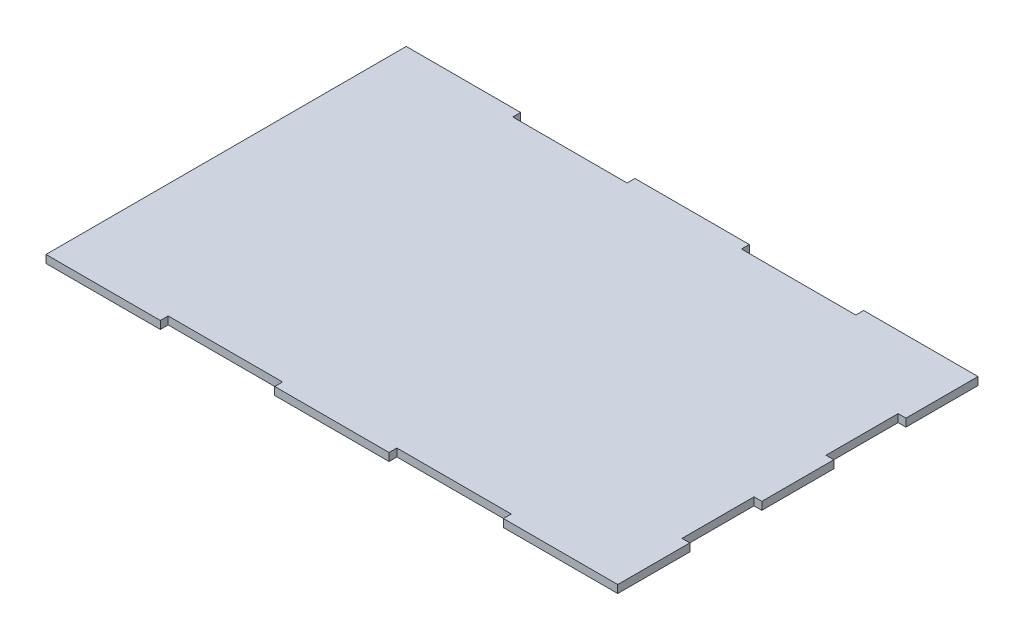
ISO-10303-21;
HEADER;
FILE_DESCRIPTION(('STEP AP214'),'2;1');
FILE_NAME('part.step','',(''),(''),'','','');
FILE_SCHEMA(('AUTOMOTIVE_DESIGN { 1 0 10303 214 1 1 1 1 }'));
ENDSEC;
DATA;
#1=APPLICATION_CONTEXT('core data for automotive mechanical design processes');
#2=APPLICATION_PROTOCOL_DEFINITION('international standard','automotive_design',2000,#1);
#3=PRODUCT_CONTEXT('',#1,'mechanical');
#4=PRODUCT('Part','Part','',(#3));
#5=PRODUCT_RELATED_PRODUCT_CATEGORY('part','',(#4));
#6=PRODUCT_DEFINITION_FORMATION('','',#4);
#7=PRODUCT_DEFINITION_CONTEXT('part definition',#1,'design');
#8=PRODUCT_DEFINITION('design','',#6,#7);
#9=PRODUCT_DEFINITION_SHAPE('','',#8);
#10=(LENGTH_UNIT() NAMED_UNIT(*) SI_UNIT(.MILLI.,.METRE.));
#11=(NAMED_UNIT(*) PLANE_ANGLE_UNIT() SI_UNIT($,.RADIAN.));
#12=(NAMED_UNIT(*) SI_UNIT($,.STERADIAN.) SOLID_ANGLE_UNIT());
#13=UNCERTAINTY_MEASURE_WITH_UNIT(LENGTH_MEASURE(1.E-05),#10,'distance_accuracy_value','');
#14=(GEOMETRIC_REPRESENTATION_CONTEXT(3) GLOBAL_UNCERTAINTY_ASSIGNED_CONTEXT((#13)) GLOBAL_UNIT_ASSIGNED_CONTEXT((#10,
#11,#12)) REPRESENTATION_CONTEXT('',''));
#15=CARTESIAN_POINT('',(0.,0.,0.));
#16=DIRECTION('',(0.,0.,1.));
#17=DIRECTION('',(1.,0.,0.));
#18=AXIS2_PLACEMENT_3D('',#15,#16,#17);
#19=CARTESIAN_POINT('',(46.355,0.,-142.875));
#20=DIRECTION('',(1.,0.,0.));
#21=DIRECTION('',(0.,0.,-1.));
#22=AXIS2_PLACEMENT_3D('',#19,#20,#21);
#23=PLANE('',#22);
#24=DIRECTION('',(0.,0.,-1.));
#25=VECTOR('',#24,1.);
#26=CARTESIAN_POINT('',(46.355,3.175,-142.875));
#27=LINE('',#26,#25);
#28=CARTESIAN_POINT('',(46.355,3.175,-142.875));
#29=VERTEX_POINT('',#28);
#30=CARTESIAN_POINT('',(46.355,3.175,-146.05));
#31=VERTEX_POINT('',#30);
#32=EDGE_CURVE('E248',#29,#31,#27,.T.);
#33=ORIENTED_EDGE('',*,*,#32,.F.);
#34=DIRECTION('',(0.,1.,0.));
#35=VECTOR('',#34,1.);
#36=CARTESIAN_POINT('',(46.355,0.,-142.875));
#37=LINE('',#36,#35);
#38=CARTESIAN_POINT('',(46.355,0.,-142.875));
#39=VERTEX_POINT('',#38);
#40=EDGE_CURVE('E11',#39,#29,#37,.T.);
#41=ORIENTED_EDGE('',*,*,#40,.F.);
#42=DIRECTION('',(0.,0.,-1.));
#43=VECTOR('',#42,1.);
#44=CARTESIAN_POINT('',(46.355,0.,-142.875));
#45=LINE('',#44,#43);
#46=CARTESIAN_POINT('',(46.355,0.,-146.05));
#47=VERTEX_POINT('',#46);
#48=EDGE_CURVE('E328',#39,#47,#45,.T.);
#49=ORIENTED_EDGE('',*,*,#48,.T.);
#50=DIRECTION('',(0.,1.,0.));
#51=VECTOR('',#50,1.);
#52=CARTESIAN_POINT('',(46.355,0.,-146.05));
#53=LINE('',#52,#51);
#54=EDGE_CURVE('E34',#47,#31,#53,.T.);
#55=ORIENTED_EDGE('',*,*,#54,.T.);
#56=EDGE_LOOP('',(#33,#41,#49,#55));
#57=FACE_BOUND('',#56,.T.);
#58=ADVANCED_FACE('F31',(#57),#23,.T.);
#59=CARTESIAN_POINT('',(92.71,0.,-142.875));
#60=DIRECTION('',(0.,0.,-1.));
#61=DIRECTION('',(-1.,0.,0.));
#62=AXIS2_PLACEMENT_3D('',#59,#60,#61);
#63=PLANE('',#62);
#64=DIRECTION('',(-1.,0.,0.));
#65=VECTOR('',#64,1.);
#66=CARTESIAN_POINT('',(92.71,3.175,-142.875));
#67=LINE('',#66,#65);
#68=CARTESIAN_POINT('',(92.71,3.175,-142.875));
#69=VERTEX_POINT('',#68);
#70=EDGE_CURVE('E326',#69,#29,#67,.T.);
#71=ORIENTED_EDGE('',*,*,#70,.F.);
#72=DIRECTION('',(0.,1.,0.));
#73=VECTOR('',#72,1.);
#74=CARTESIAN_POINT('',(92.71,0.,-142.875));
#75=LINE('',#74,#73);
#76=CARTESIAN_POINT('',(92.71,0.,-142.875));
#77=VERTEX_POINT('',#76);
#78=EDGE_CURVE('E40',#77,#69,#75,.T.);
#79=ORIENTED_EDGE('',*,*,#78,.F.);
#80=DIRECTION('',(-1.,0.,0.));
#81=VECTOR('',#80,1.);
#82=CARTESIAN_POINT('',(92.71,0.,-142.875));
#83=LINE('',#82,#81);
#84=EDGE_CURVE('E238',#77,#39,#83,.T.);
#85=ORIENTED_EDGE('',*,*,#84,.T.);
#86=ORIENTED_EDGE('',*,*,#40,.T.);
#87=EDGE_LOOP('',(#71,#79,#85,#86));
#88=FACE_BOUND('',#87,.T.);
#89=ADVANCED_FACE('F380',(#88),#63,.T.);
#90=CARTESIAN_POINT('',(92.71,0.,-146.05));
#91=DIRECTION('',(-1.,0.,0.));
#92=DIRECTION('',(0.,0.,1.));
#93=AXIS2_PLACEMENT_3D('',#90,#91,#92);
#94=PLANE('',#93);
#95=DIRECTION('',(0.,0.,1.));
#96=VECTOR('',#95,1.);
#97=CARTESIAN_POINT('',(92.71,3.175,-146.05));
#98=LINE('',#97,#96);
#99=CARTESIAN_POINT('',(92.71,3.175,-146.05));
#100=VERTEX_POINT('',#99);
#101=EDGE_CURVE('E225',#100,#69,#98,.T.);
#102=ORIENTED_EDGE('',*,*,#101,.F.);
#103=DIRECTION('',(0.,1.,0.));
#104=VECTOR('',#103,1.);
#105=CARTESIAN_POINT('',(92.71,0.,-146.05));
#106=LINE('',#105,#104);
#107=CARTESIAN_POINT('',(92.71,0.,-146.05));
#108=VERTEX_POINT('',#107);
#109=EDGE_CURVE('E220',#108,#100,#106,.T.);
#110=ORIENTED_EDGE('',*,*,#109,.F.);
#111=DIRECTION('',(0.,0.,1.));
#112=VECTOR('',#111,1.);
#113=CARTESIAN_POINT('',(92.71,0.,-146.05));
#114=LINE('',#113,#112);
#115=EDGE_CURVE('E223',#108,#77,#114,.T.);
#116=ORIENTED_EDGE('',*,*,#115,.T.);
#117=ORIENTED_EDGE('',*,*,#78,.T.);
#118=EDGE_LOOP('',(#102,#110,#116,#117));
#119=FACE_BOUND('',#118,.T.);
#120=ADVANCED_FACE('F222',(#119),#94,.T.);
#121=CARTESIAN_POINT('',(139.065,0.,-146.05));
#122=DIRECTION('',(0.,0.,-1.));
#123=DIRECTION('',(-1.,0.,0.));
#124=AXIS2_PLACEMENT_3D('',#121,#122,#123);
#125=PLANE('',#124);
#126=DIRECTION('',(-1.,0.,0.));
#127=VECTOR('',#126,1.);
#128=CARTESIAN_POINT('',(139.065,3.175,-146.05));
#129=LINE('',#128,#127);
#130=CARTESIAN_POINT('',(139.065,3.175,-146.05));
#131=VERTEX_POINT('',#130);
#132=EDGE_CURVE('E323',#131,#100,#129,.T.);
#133=ORIENTED_EDGE('',*,*,#132,.F.);
#134=DIRECTION('',(0.,1.,0.));
#135=VECTOR('',#134,1.);
#136=CARTESIAN_POINT('',(139.065,0.,-146.05));
#137=LINE('',#136,#135);
#138=CARTESIAN_POINT('',(139.065,0.,-146.05));
#139=VERTEX_POINT('',#138);
#140=EDGE_CURVE('E230',#139,#131,#137,.T.);
#141=ORIENTED_EDGE('',*,*,#140,.F.);
#142=DIRECTION('',(-1.,0.,0.));
#143=VECTOR('',#142,1.);
#144=CARTESIAN_POINT('',(139.065,0.,-146.05));
#145=LINE('',#144,#143);
#146=EDGE_CURVE('E236',#139,#108,#145,.T.);
#147=ORIENTED_EDGE('',*,*,#146,.T.);
#148=ORIENTED_EDGE('',*,*,#109,.T.);
#149=EDGE_LOOP('',(#133,#141,#147,#148));
#150=FACE_BOUND('',#149,.T.);
#151=ADVANCED_FACE('F240',(#150),#125,.T.);
#152=CARTESIAN_POINT('',(139.065,0.,-142.875));
#153=DIRECTION('',(1.,0.,0.));
#154=DIRECTION('',(0.,0.,-1.));
#155=AXIS2_PLACEMENT_3D('',#152,#153,#154);
#156=PLANE('',#155);
#157=DIRECTION('',(0.,0.,-1.));
#158=VECTOR('',#157,1.);
#159=CARTESIAN_POINT('',(139.065,3.175,-142.875));
#160=LINE('',#159,#158);
#161=CARTESIAN_POINT('',(139.065,3.175,-142.875));
#162=VERTEX_POINT('',#161);
#163=EDGE_CURVE('E320',#162,#131,#160,.T.);
#164=ORIENTED_EDGE('',*,*,#163,.F.);
#165=DIRECTION('',(0.,1.,0.));
#166=VECTOR('',#165,1.);
#167=CARTESIAN_POINT('',(139.065,0.,-142.875));
#168=LINE('',#167,#166);
#169=CARTESIAN_POINT('',(139.065,0.,-142.875));
#170=VERTEX_POINT('',#169);
#171=EDGE_CURVE('E332',#170,#162,#168,.T.);
#172=ORIENTED_EDGE('',*,*,#171,.F.);
#173=DIRECTION('',(0.,0.,-1.));
#174=VECTOR('',#173,1.);
#175=CARTESIAN_POINT('',(139.065,0.,-142.875));
#176=LINE('',#175,#174);
#177=EDGE_CURVE('E241',#170,#139,#176,.T.);
#178=ORIENTED_EDGE('',*,*,#177,.T.);
#179=ORIENTED_EDGE('',*,*,#140,.T.);
#180=EDGE_LOOP('',(#164,#172,#178,#179));
#181=FACE_BOUND('',#180,.T.);
#182=ADVANCED_FACE('F393',(#181),#156,.T.);
#183=CARTESIAN_POINT('',(185.42,0.,-142.875));
#184=DIRECTION('',(0.,0.,-1.));
#185=DIRECTION('',(-1.,0.,0.));
#186=AXIS2_PLACEMENT_3D('',#183,#184,#185);
#187=PLANE('',#186);
#188=DIRECTION('',(-1.,0.,0.));
#189=VECTOR('',#188,1.);
#190=CARTESIAN_POINT('',(185.42,3.175,-142.875));
#191=LINE('',#190,#189);
#192=CARTESIAN_POINT('',(185.42,3.175,-142.875));
#193=VERTEX_POINT('',#192);
#194=EDGE_CURVE('E317',#193,#162,#191,.T.);
#195=ORIENTED_EDGE('',*,*,#194,.F.);
#196=DIRECTION('',(0.,1.,0.));
#197=VECTOR('',#196,1.);
#198=CARTESIAN_POINT('',(185.42,0.,-142.875));
#199=LINE('',#198,#197);
#200=CARTESIAN_POINT('',(185.42,0.,-142.875));
#201=VERTEX_POINT('',#200);
#202=EDGE_CURVE('E334',#201,#193,#199,.T.);
#203=ORIENTED_EDGE('',*,*,#202,.F.);
#204=DIRECTION('',(-1.,0.,0.));
#205=VECTOR('',#204,1.);
#206=CARTESIAN_POINT('',(185.42,0.,-142.875));
#207=LINE('',#206,#205);
#208=EDGE_CURVE('E243',#201,#170,#207,.T.);
#209=ORIENTED_EDGE('',*,*,#208,.T.);
#210=ORIENTED_EDGE('',*,*,#171,.T.);
#211=EDGE_LOOP('',(#195,#203,#209,#210));
#212=FACE_BOUND('',#211,.T.);
#213=ADVANCED_FACE('F396',(#212),#187,.T.);
#214=CARTESIAN_POINT('',(185.42,0.,-146.05));
#215=DIRECTION('',(-1.,0.,0.));
#216=DIRECTION('',(0.,0.,1.));
#217=AXIS2_PLACEMENT_3D('',#214,#215,#216);
#218=PLANE('',#217);
#219=DIRECTION('',(0.,0.,1.));
#220=VECTOR('',#219,1.);
#221=CARTESIAN_POINT('',(185.42,3.175,-146.05));
#222=LINE('',#221,#220);
#223=CARTESIAN_POINT('',(185.42,3.175,-146.05));
#224=VERTEX_POINT('',#223);
#225=EDGE_CURVE('E314',#224,#193,#222,.T.);
#226=ORIENTED_EDGE('',*,*,#225,.F.);
#227=DIRECTION('',(0.,1.,0.));
#228=VECTOR('',#227,1.);
#229=CARTESIAN_POINT('',(185.42,0.,-146.05));
#230=LINE('',#229,#228);
#231=CARTESIAN_POINT('',(185.42,0.,-146.05));
#232=VERTEX_POINT('',#231);
#233=EDGE_CURVE('E336',#232,#224,#230,.T.);
#234=ORIENTED_EDGE('',*,*,#233,.F.);
#235=DIRECTION('',(0.,0.,1.));
#236=VECTOR('',#235,1.);
#237=CARTESIAN_POINT('',(185.42,0.,-146.05));
#238=LINE('',#237,#236);
#239=EDGE_CURVE('E741',#232,#201,#238,.T.);
#240=ORIENTED_EDGE('',*,*,#239,.T.);
#241=ORIENTED_EDGE('',*,*,#202,.T.);
#242=EDGE_LOOP('',(#226,#234,#240,#241));
#243=FACE_BOUND('',#242,.T.);
#244=ADVANCED_FACE('F400',(#243),#218,.T.);
#245=CARTESIAN_POINT('',(231.775,0.,-146.05));
#246=DIRECTION('',(0.,0.,-1.));
#247=DIRECTION('',(-1.,0.,0.));
#248=AXIS2_PLACEMENT_3D('',#245,#246,#247);
#249=PLANE('',#248);
#250=DIRECTION('',(-1.,0.,0.));
#251=VECTOR('',#250,1.);
#252=CARTESIAN_POINT('',(231.775,3.175,-146.05));
#253=LINE('',#252,#251);
#254=CARTESIAN_POINT('',(231.775,3.175,-146.05));
#255=VERTEX_POINT('',#254);
#256=EDGE_CURVE('E311',#255,#224,#253,.T.);
#257=ORIENTED_EDGE('',*,*,#256,.F.);
#258=DIRECTION('',(0.,1.,0.));
#259=VECTOR('',#258,1.);
#260=CARTESIAN_POINT('',(231.775,0.,-146.05));
#261=LINE('',#260,#259);
#262=CARTESIAN_POINT('',(231.775,0.,-146.05));
#263=VERTEX_POINT('',#262);
#264=EDGE_CURVE('E338',#263,#255,#261,.T.);
#265=ORIENTED_EDGE('',*,*,#264,.F.);
#266=DIRECTION('',(-1.,0.,0.));
#267=VECTOR('',#266,1.);
#268=CARTESIAN_POINT('',(231.775,0.,-146.05));
#269=LINE('',#268,#267);
#270=EDGE_CURVE('E737',#263,#232,#269,.T.);
#271=ORIENTED_EDGE('',*,*,#270,.T.);
#272=ORIENTED_EDGE('',*,*,#233,.T.);
#273=EDGE_LOOP('',(#257,#265,#271,#272));
#274=FACE_BOUND('',#273,.T.);
#275=ADVANCED_FACE('F404',(#274),#249,.T.);
#276=CARTESIAN_POINT('',(231.775,0.,-116.84));
#277=DIRECTION('',(1.,0.,0.));
#278=DIRECTION('',(0.,0.,-1.));
#279=AXIS2_PLACEMENT_3D('',#276,#277,#278);
#280=PLANE('',#279);
#281=DIRECTION('',(0.,0.,-1.));
#282=VECTOR('',#281,1.);
#283=CARTESIAN_POINT('',(231.775,3.175,-116.84));
#284=LINE('',#283,#282);
#285=CARTESIAN_POINT('',(231.775,3.175,-116.84));
#286=VERTEX_POINT('',#285);
#287=EDGE_CURVE('E308',#286,#255,#284,.T.);
#288=ORIENTED_EDGE('',*,*,#287,.F.);
#289=DIRECTION('',(0.,1.,0.));
#290=VECTOR('',#289,1.);
#291=CARTESIAN_POINT('',(231.775,0.,-116.84));
#292=LINE('',#291,#290);
#293=CARTESIAN_POINT('',(231.775,0.,-116.84));
#294=VERTEX_POINT('',#293);
#295=EDGE_CURVE('E340',#294,#286,#292,.T.);
#296=ORIENTED_EDGE('',*,*,#295,.F.);
#297=DIRECTION('',(0.,0.,-1.));
#298=VECTOR('',#297,1.);
#299=CARTESIAN_POINT('',(231.775,0.,-116.84));
#300=LINE('',#299,#298);
#301=EDGE_CURVE('E748',#294,#263,#300,.T.);
#302=ORIENTED_EDGE('',*,*,#301,.T.);
#303=ORIENTED_EDGE('',*,*,#264,.T.);
#304=EDGE_LOOP('',(#288,#296,#302,#303));
#305=FACE_BOUND('',#304,.T.);
#306=ADVANCED_FACE('F408',(#305),#280,.T.);
#307=CARTESIAN_POINT('',(228.6,0.,-116.84));
#308=DIRECTION('',(0.,0.,1.));
#309=DIRECTION('',(1.,0.,0.));
#310=AXIS2_PLACEMENT_3D('',#307,#308,#309);
#311=PLANE('',#310);
#312=DIRECTION('',(1.,0.,0.));
#313=VECTOR('',#312,1.);
#314=CARTESIAN_POINT('',(228.6,3.175,-116.84));
#315=LINE('',#314,#313);
#316=CARTESIAN_POINT('',(228.6,3.175,-116.84));
#317=VERTEX_POINT('',#316);
#318=EDGE_CURVE('E305',#317,#286,#315,.T.);
#319=ORIENTED_EDGE('',*,*,#318,.F.);
#320=DIRECTION('',(0.,1.,0.));
#321=VECTOR('',#320,1.);
#322=CARTESIAN_POINT('',(228.6,0.,-116.84));
#323=LINE('',#322,#321);
#324=CARTESIAN_POINT('',(228.6,0.,-116.84));
#325=VERTEX_POINT('',#324);
#326=EDGE_CURVE('E342',#325,#317,#323,.T.);
#327=ORIENTED_EDGE('',*,*,#326,.F.);
#328=DIRECTION('',(1.,0.,0.));
#329=VECTOR('',#328,1.);
#330=CARTESIAN_POINT('',(228.6,0.,-116.84));
#331=LINE('',#330,#329);
#332=EDGE_CURVE('E730',#325,#294,#331,.T.);
#333=ORIENTED_EDGE('',*,*,#332,.T.);
#334=ORIENTED_EDGE('',*,*,#295,.T.);
#335=EDGE_LOOP('',(#319,#327,#333,#334));
#336=FACE_BOUND('',#335,.T.);
#337=ADVANCED_FACE('F412',(#336),#311,.T.);
#338=CARTESIAN_POINT('',(228.6,0.,-87.63));
#339=DIRECTION('',(1.,0.,0.));
#340=DIRECTION('',(0.,0.,-1.));
#341=AXIS2_PLACEMENT_3D('',#338,#339,#340);
#342=PLANE('',#341);
#343=DIRECTION('',(0.,0.,-1.));
#344=VECTOR('',#343,1.);
#345=CARTESIAN_POINT('',(228.6,3.175,-87.63));
#346=LINE('',#345,#344);
#347=CARTESIAN_POINT('',(228.6,3.175,-87.63));
#348=VERTEX_POINT('',#347);
#349=EDGE_CURVE('E302',#348,#317,#346,.T.);
#350=ORIENTED_EDGE('',*,*,#349,.F.);
#351=DIRECTION('',(0.,1.,0.));
#352=VECTOR('',#351,1.);
#353=CARTESIAN_POINT('',(228.6,0.,-87.63));
#354=LINE('',#353,#352);
#355=CARTESIAN_POINT('',(228.6,0.,-87.63));
#356=VERTEX_POINT('',#355);
#357=EDGE_CURVE('E344',#356,#348,#354,.T.);
#358=ORIENTED_EDGE('',*,*,#357,.F.);
#359=DIRECTION('',(0.,0.,-1.));
#360=VECTOR('',#359,1.);
#361=CARTESIAN_POINT('',(228.6,0.,-87.63));
#362=LINE('',#361,#360);
#363=EDGE_CURVE('E726',#356,#325,#362,.T.);
#364=ORIENTED_EDGE('',*,*,#363,.T.);
#365=ORIENTED_EDGE('',*,*,#326,.T.);
#366=EDGE_LOOP('',(#350,#358,#364,#365));
#367=FACE_BOUND('',#366,.T.);
#368=ADVANCED_FACE('F416',(#367),#342,.T.);
#369=CARTESIAN_POINT('',(231.775,0.,-87.63));
#370=DIRECTION('',(0.,0.,-1.));
#371=DIRECTION('',(-1.,0.,0.));
#372=AXIS2_PLACEMENT_3D('',#369,#370,#371);
#373=PLANE('',#372);
#374=DIRECTION('',(-1.,0.,0.));
#375=VECTOR('',#374,1.);
#376=CARTESIAN_POINT('',(231.775,3.175,-87.63));
#377=LINE('',#376,#375);
#378=CARTESIAN_POINT('',(231.775,3.175,-87.63));
#379=VERTEX_POINT('',#378);
#380=EDGE_CURVE('E299',#379,#348,#377,.T.);
#381=ORIENTED_EDGE('',*,*,#380,.F.);
#382=DIRECTION('',(0.,1.,0.));
#383=VECTOR('',#382,1.);
#384=CARTESIAN_POINT('',(231.775,0.,-87.63));
#385=LINE('',#384,#383);
#386=CARTESIAN_POINT('',(231.775,0.,-87.63));
#387=VERTEX_POINT('',#386);
#388=EDGE_CURVE('E346',#387,#379,#385,.T.);
#389=ORIENTED_EDGE('',*,*,#388,.F.);
#390=DIRECTION('',(-1.,0.,0.));
#391=VECTOR('',#390,1.);
#392=CARTESIAN_POINT('',(231.775,0.,-87.63));
#393=LINE('',#392,#391);
#394=EDGE_CURVE('E752',#387,#356,#393,.T.);
#395=ORIENTED_EDGE('',*,*,#394,.T.);
#396=ORIENTED_EDGE('',*,*,#357,.T.);
#397=EDGE_LOOP('',(#381,#389,#395,#396));
#398=FACE_BOUND('',#397,.T.);
#399=ADVANCED_FACE('F420',(#398),#373,.T.);
#400=CARTESIAN_POINT('',(231.775,0.,-58.42));
#401=DIRECTION('',(1.,0.,0.));
#402=DIRECTION('',(0.,0.,-1.));
#403=AXIS2_PLACEMENT_3D('',#400,#401,#402);
#404=PLANE('',#403);
#405=DIRECTION('',(0.,0.,-1.));
#406=VECTOR('',#405,1.);
#407=CARTESIAN_POINT('',(231.775,3.175,-58.42));
#408=LINE('',#407,#406);
#409=CARTESIAN_POINT('',(231.775,3.175,-58.42));
#410=VERTEX_POINT('',#409);
#411=EDGE_CURVE('E296',#410,#379,#408,.T.);
#412=ORIENTED_EDGE('',*,*,#411,.F.);
#413=DIRECTION('',(0.,1.,0.));
#414=VECTOR('',#413,1.);
#415=CARTESIAN_POINT('',(231.775,0.,-58.42));
#416=LINE('',#415,#414);
#417=CARTESIAN_POINT('',(231.775,0.,-58.42));
#418=VERTEX_POINT('',#417);
#419=EDGE_CURVE('E348',#418,#410,#416,.T.);
#420=ORIENTED_EDGE('',*,*,#419,.F.);
#421=DIRECTION('',(0.,0.,-1.));
#422=VECTOR('',#421,1.);
#423=CARTESIAN_POINT('',(231.775,0.,-58.42));
#424=LINE('',#423,#422);
#425=EDGE_CURVE('E719',#418,#387,#424,.T.);
#426=ORIENTED_EDGE('',*,*,#425,.T.);
#427=ORIENTED_EDGE('',*,*,#388,.T.);
#428=EDGE_LOOP('',(#412,#420,#426,#427));
#429=FACE_BOUND('',#428,.T.);
#430=ADVANCED_FACE('F424',(#429),#404,.T.);
#431=CARTESIAN_POINT('',(228.6,0.,-58.42));
#432=DIRECTION('',(0.,0.,1.));
#433=DIRECTION('',(1.,0.,0.));
#434=AXIS2_PLACEMENT_3D('',#431,#432,#433);
#435=PLANE('',#434);
#436=DIRECTION('',(1.,0.,0.));
#437=VECTOR('',#436,1.);
#438=CARTESIAN_POINT('',(228.6,3.175,-58.42));
#439=LINE('',#438,#437);
#440=CARTESIAN_POINT('',(228.6,3.175,-58.42));
#441=VERTEX_POINT('',#440);
#442=EDGE_CURVE('E293',#441,#410,#439,.T.);
#443=ORIENTED_EDGE('',*,*,#442,.F.);
#444=DIRECTION('',(0.,1.,0.));
#445=VECTOR('',#444,1.);
#446=CARTESIAN_POINT('',(228.6,0.,-58.42));
#447=LINE('',#446,#445);
#448=CARTESIAN_POINT('',(228.6,0.,-58.42));
#449=VERTEX_POINT('',#448);
#450=EDGE_CURVE('E350',#449,#441,#447,.T.);
#451=ORIENTED_EDGE('',*,*,#450,.F.);
#452=DIRECTION('',(1.,0.,0.));
#453=VECTOR('',#452,1.);
#454=CARTESIAN_POINT('',(228.6,0.,-58.42));
#455=LINE('',#454,#453);
#456=EDGE_CURVE('E715',#449,#418,#455,.T.);
#457=ORIENTED_EDGE('',*,*,#456,.T.);
#458=ORIENTED_EDGE('',*,*,#419,.T.);
#459=EDGE_LOOP('',(#443,#451,#457,#458));
#460=FACE_BOUND('',#459,.T.);
#461=ADVANCED_FACE('F428',(#460),#435,.T.);
#462=CARTESIAN_POINT('',(228.6,0.,-29.21));
#463=DIRECTION('',(1.,0.,0.));
#464=DIRECTION('',(0.,0.,-1.));
#465=AXIS2_PLACEMENT_3D('',#462,#463,#464);
#466=PLANE('',#465);
#467=DIRECTION('',(0.,0.,-1.));
#468=VECTOR('',#467,1.);
#469=CARTESIAN_POINT('',(228.6,3.175,-29.21));
#470=LINE('',#469,#468);
#471=CARTESIAN_POINT('',(228.6,3.175,-29.21));
#472=VERTEX_POINT('',#471);
#473=EDGE_CURVE('E290',#472,#441,#470,.T.);
#474=ORIENTED_EDGE('',*,*,#473,.F.);
#475=DIRECTION('',(0.,1.,0.));
#476=VECTOR('',#475,1.);
#477=CARTESIAN_POINT('',(228.6,0.,-29.21));
#478=LINE('',#477,#476);
#479=CARTESIAN_POINT('',(228.6,0.,-29.21));
#480=VERTEX_POINT('',#479);
#481=EDGE_CURVE('E352',#480,#472,#478,.T.);
#482=ORIENTED_EDGE('',*,*,#481,.F.);
#483=DIRECTION('',(0.,0.,-1.));
#484=VECTOR('',#483,1.);
#485=CARTESIAN_POINT('',(228.6,0.,-29.21));
#486=LINE('',#485,#484);
#487=EDGE_CURVE('E756',#480,#449,#486,.T.);
#488=ORIENTED_EDGE('',*,*,#487,.T.);
#489=ORIENTED_EDGE('',*,*,#450,.T.);
#490=EDGE_LOOP('',(#474,#482,#488,#489));
#491=FACE_BOUND('',#490,.T.);
#492=ADVANCED_FACE('F432',(#491),#466,.T.);
#493=CARTESIAN_POINT('',(231.775,0.,-29.21));
#494=DIRECTION('',(0.,0.,-1.));
#495=DIRECTION('',(-1.,0.,0.));
#496=AXIS2_PLACEMENT_3D('',#493,#494,#495);
#497=PLANE('',#496);
#498=DIRECTION('',(-1.,0.,0.));
#499=VECTOR('',#498,1.);
#500=CARTESIAN_POINT('',(231.775,3.175,-29.21));
#501=LINE('',#500,#499);
#502=CARTESIAN_POINT('',(231.775,3.175,-29.21));
#503=VERTEX_POINT('',#502);
#504=EDGE_CURVE('E287',#503,#472,#501,.T.);
#505=ORIENTED_EDGE('',*,*,#504,.F.);
#506=DIRECTION('',(0.,1.,0.));
#507=VECTOR('',#506,1.);
#508=CARTESIAN_POINT('',(231.775,0.,-29.21));
#509=LINE('',#508,#507);
#510=CARTESIAN_POINT('',(231.775,0.,-29.21));
#511=VERTEX_POINT('',#510);
#512=EDGE_CURVE('E354',#511,#503,#509,.T.);
#513=ORIENTED_EDGE('',*,*,#512,.F.);
#514=DIRECTION('',(-1.,0.,0.));
#515=VECTOR('',#514,1.);
#516=CARTESIAN_POINT('',(231.775,0.,-29.21));
#517=LINE('',#516,#515);
#518=EDGE_CURVE('E708',#511,#480,#517,.T.);
#519=ORIENTED_EDGE('',*,*,#518,.T.);
#520=ORIENTED_EDGE('',*,*,#481,.T.);
#521=EDGE_LOOP('',(#505,#513,#519,#520));
#522=FACE_BOUND('',#521,.T.);
#523=ADVANCED_FACE('F436',(#522),#497,.T.);
#524=CARTESIAN_POINT('',(231.775,0.,0.));
#525=DIRECTION('',(1.,0.,0.));
#526=DIRECTION('',(0.,0.,-1.));
#527=AXIS2_PLACEMENT_3D('',#524,#525,#526);
#528=PLANE('',#527);
#529=DIRECTION('',(0.,0.,-1.));
#530=VECTOR('',#529,1.);
#531=CARTESIAN_POINT('',(231.775,3.175,0.));
#532=LINE('',#531,#530);
#533=CARTESIAN_POINT('',(231.775,3.175,0.));
#534=VERTEX_POINT('',#533);
#535=EDGE_CURVE('E284',#534,#503,#532,.T.);
#536=ORIENTED_EDGE('',*,*,#535,.F.);
#537=DIRECTION('',(0.,1.,0.));
#538=VECTOR('',#537,1.);
#539=CARTESIAN_POINT('',(231.775,0.,0.));
#540=LINE('',#539,#538);
#541=CARTESIAN_POINT('',(231.775,0.,0.));
#542=VERTEX_POINT('',#541);
#543=EDGE_CURVE('E356',#542,#534,#540,.T.);
#544=ORIENTED_EDGE('',*,*,#543,.F.);
#545=DIRECTION('',(0.,0.,-1.));
#546=VECTOR('',#545,1.);
#547=CARTESIAN_POINT('',(231.775,0.,0.));
#548=LINE('',#547,#546);
#549=EDGE_CURVE('E704',#542,#511,#548,.T.);
#550=ORIENTED_EDGE('',*,*,#549,.T.);
#551=ORIENTED_EDGE('',*,*,#512,.T.);
#552=EDGE_LOOP('',(#536,#544,#550,#551));
#553=FACE_BOUND('',#552,.T.);
#554=ADVANCED_FACE('F440',(#553),#528,.T.);
#555=CARTESIAN_POINT('',(185.42,0.,0.));
#556=DIRECTION('',(0.,0.,1.));
#557=DIRECTION('',(1.,0.,0.));
#558=AXIS2_PLACEMENT_3D('',#555,#556,#557);
#559=PLANE('',#558);
#560=DIRECTION('',(1.,0.,0.));
#561=VECTOR('',#560,1.);
#562=CARTESIAN_POINT('',(185.42,3.175,0.));
#563=LINE('',#562,#561);
#564=CARTESIAN_POINT('',(185.42,3.175,0.));
#565=VERTEX_POINT('',#564);
#566=EDGE_CURVE('E281',#565,#534,#563,.T.);
#567=ORIENTED_EDGE('',*,*,#566,.F.);
#568=DIRECTION('',(0.,1.,0.));
#569=VECTOR('',#568,1.);
#570=CARTESIAN_POINT('',(185.42,0.,0.));
#571=LINE('',#570,#569);
#572=CARTESIAN_POINT('',(185.42,0.,0.));
#573=VERTEX_POINT('',#572);
#574=EDGE_CURVE('E358',#573,#565,#571,.T.);
#575=ORIENTED_EDGE('',*,*,#574,.F.);
#576=DIRECTION('',(1.,0.,0.));
#577=VECTOR('',#576,1.);
#578=CARTESIAN_POINT('',(185.42,0.,0.));
#579=LINE('',#578,#577);
#580=EDGE_CURVE('E760',#573,#542,#579,.T.);
#581=ORIENTED_EDGE('',*,*,#580,.T.);
#582=ORIENTED_EDGE('',*,*,#543,.T.);
#583=EDGE_LOOP('',(#567,#575,#581,#582));
#584=FACE_BOUND('',#583,.T.);
#585=ADVANCED_FACE('F444',(#584),#559,.T.);
#586=CARTESIAN_POINT('',(185.42,0.,-3.175));
#587=DIRECTION('',(-1.,0.,0.));
#588=DIRECTION('',(0.,0.,1.));
#589=AXIS2_PLACEMENT_3D('',#586,#587,#588);
#590=PLANE('',#589);
#591=DIRECTION('',(0.,0.,1.));
#592=VECTOR('',#591,1.);
#593=CARTESIAN_POINT('',(185.42,3.175,-3.175));
#594=LINE('',#593,#592);
#595=CARTESIAN_POINT('',(185.42,3.175,-3.175));
#596=VERTEX_POINT('',#595);
#597=EDGE_CURVE('E278',#596,#565,#594,.T.);
#598=ORIENTED_EDGE('',*,*,#597,.F.);
#599=DIRECTION('',(0.,1.,0.));
#600=VECTOR('',#599,1.);
#601=CARTESIAN_POINT('',(185.42,0.,-3.175));
#602=LINE('',#601,#600);
#603=CARTESIAN_POINT('',(185.42,0.,-3.175));
#604=VERTEX_POINT('',#603);
#605=EDGE_CURVE('E360',#604,#596,#602,.T.);
#606=ORIENTED_EDGE('',*,*,#605,.F.);
#607=DIRECTION('',(0.,0.,1.));
#608=VECTOR('',#607,1.);
#609=CARTESIAN_POINT('',(185.42,0.,-3.175));
#610=LINE('',#609,#608);
#611=EDGE_CURVE('E697',#604,#573,#610,.T.);
#612=ORIENTED_EDGE('',*,*,#611,.T.);
#613=ORIENTED_EDGE('',*,*,#574,.T.);
#614=EDGE_LOOP('',(#598,#606,#612,#613));
#615=FACE_BOUND('',#614,.T.);
#616=ADVANCED_FACE('F448',(#615),#590,.T.);
#617=CARTESIAN_POINT('',(139.065,0.,-3.175));
#618=DIRECTION('',(0.,0.,1.));
#619=DIRECTION('',(1.,0.,0.));
#620=AXIS2_PLACEMENT_3D('',#617,#618,#619);
#621=PLANE('',#620);
#622=DIRECTION('',(1.,0.,0.));
#623=VECTOR('',#622,1.);
#624=CARTESIAN_POINT('',(139.065,3.175,-3.175));
#625=LINE('',#624,#623);
#626=CARTESIAN_POINT('',(139.065,3.175,-3.175));
#627=VERTEX_POINT('',#626);
#628=EDGE_CURVE('E275',#627,#596,#625,.T.);
#629=ORIENTED_EDGE('',*,*,#628,.F.);
#630=DIRECTION('',(0.,1.,0.));
#631=VECTOR('',#630,1.);
#632=CARTESIAN_POINT('',(139.065,0.,-3.175));
#633=LINE('',#632,#631);
#634=CARTESIAN_POINT('',(139.065,0.,-3.175));
#635=VERTEX_POINT('',#634);
#636=EDGE_CURVE('E362',#635,#627,#633,.T.);
#637=ORIENTED_EDGE('',*,*,#636,.F.);
#638=DIRECTION('',(1.,0.,0.));
#639=VECTOR('',#638,1.);
#640=CARTESIAN_POINT('',(139.065,0.,-3.175));
#641=LINE('',#640,#639);
#642=EDGE_CURVE('E693',#635,#604,#641,.T.);
#643=ORIENTED_EDGE('',*,*,#642,.T.);
#644=ORIENTED_EDGE('',*,*,#605,.T.);
#645=EDGE_LOOP('',(#629,#637,#643,#644));
#646=FACE_BOUND('',#645,.T.);
#647=ADVANCED_FACE('F452',(#646),#621,.T.);
#648=CARTESIAN_POINT('',(139.065,0.,0.));
#649=DIRECTION('',(1.,0.,0.));
#650=DIRECTION('',(0.,0.,-1.));
#651=AXIS2_PLACEMENT_3D('',#648,#649,#650);
#652=PLANE('',#651);
#653=DIRECTION('',(0.,0.,-1.));
#654=VECTOR('',#653,1.);
#655=CARTESIAN_POINT('',(139.065,3.175,0.));
#656=LINE('',#655,#654);
#657=CARTESIAN_POINT('',(139.065,3.175,0.));
#658=VERTEX_POINT('',#657);
#659=EDGE_CURVE('E272',#658,#627,#656,.T.);
#660=ORIENTED_EDGE('',*,*,#659,.F.);
#661=DIRECTION('',(0.,1.,0.));
#662=VECTOR('',#661,1.);
#663=CARTESIAN_POINT('',(139.065,0.,0.));
#664=LINE('',#663,#662);
#665=CARTESIAN_POINT('',(139.065,0.,0.));
#666=VERTEX_POINT('',#665);
#667=EDGE_CURVE('E364',#666,#658,#664,.T.);
#668=ORIENTED_EDGE('',*,*,#667,.F.);
#669=DIRECTION('',(0.,0.,-1.));
#670=VECTOR('',#669,1.);
#671=CARTESIAN_POINT('',(139.065,0.,0.));
#672=LINE('',#671,#670);
#673=EDGE_CURVE('E764',#666,#635,#672,.T.);
#674=ORIENTED_EDGE('',*,*,#673,.T.);
#675=ORIENTED_EDGE('',*,*,#636,.T.);
#676=EDGE_LOOP('',(#660,#668,#674,#675));
#677=FACE_BOUND('',#676,.T.);
#678=ADVANCED_FACE('F456',(#677),#652,.T.);
#679=CARTESIAN_POINT('',(92.71,0.,0.));
#680=DIRECTION('',(0.,0.,1.));
#681=DIRECTION('',(1.,0.,0.));
#682=AXIS2_PLACEMENT_3D('',#679,#680,#681);
#683=PLANE('',#682);
#684=DIRECTION('',(1.,0.,0.));
#685=VECTOR('',#684,1.);
#686=CARTESIAN_POINT('',(92.71,3.175,0.));
#687=LINE('',#686,#685);
#688=CARTESIAN_POINT('',(92.71,3.175,0.));
#689=VERTEX_POINT('',#688);
#690=EDGE_CURVE('E269',#689,#658,#687,.T.);
#691=ORIENTED_EDGE('',*,*,#690,.F.);
#692=DIRECTION('',(0.,1.,0.));
#693=VECTOR('',#692,1.);
#694=CARTESIAN_POINT('',(92.71,0.,0.));
#695=LINE('',#694,#693);
#696=CARTESIAN_POINT('',(92.71,0.,0.));
#697=VERTEX_POINT('',#696);
#698=EDGE_CURVE('E366',#697,#689,#695,.T.);
#699=ORIENTED_EDGE('',*,*,#698,.F.);
#700=DIRECTION('',(1.,0.,0.));
#701=VECTOR('',#700,1.);
#702=CARTESIAN_POINT('',(92.71,0.,0.));
#703=LINE('',#702,#701);
#704=EDGE_CURVE('E686',#697,#666,#703,.T.);
#705=ORIENTED_EDGE('',*,*,#704,.T.);
#706=ORIENTED_EDGE('',*,*,#667,.T.);
#707=EDGE_LOOP('',(#691,#699,#705,#706));
#708=FACE_BOUND('',#707,.T.);
#709=ADVANCED_FACE('F460',(#708),#683,.T.);
#710=CARTESIAN_POINT('',(92.71,0.,-3.175));
#711=DIRECTION('',(-1.,0.,0.));
#712=DIRECTION('',(0.,0.,1.));
#713=AXIS2_PLACEMENT_3D('',#710,#711,#712);
#714=PLANE('',#713);
#715=DIRECTION('',(0.,0.,1.));
#716=VECTOR('',#715,1.);
#717=CARTESIAN_POINT('',(92.71,3.175,-3.175));
#718=LINE('',#717,#716);
#719=CARTESIAN_POINT('',(92.71,3.175,-3.175));
#720=VERTEX_POINT('',#719);
#721=EDGE_CURVE('E266',#720,#689,#718,.T.);
#722=ORIENTED_EDGE('',*,*,#721,.F.);
#723=DIRECTION('',(0.,1.,0.));
#724=VECTOR('',#723,1.);
#725=CARTESIAN_POINT('',(92.71,0.,-3.175));
#726=LINE('',#725,#724);
#727=CARTESIAN_POINT('',(92.71,0.,-3.175));
#728=VERTEX_POINT('',#727);
#729=EDGE_CURVE('E368',#728,#720,#726,.T.);
#730=ORIENTED_EDGE('',*,*,#729,.F.);
#731=DIRECTION('',(0.,0.,1.));
#732=VECTOR('',#731,1.);
#733=CARTESIAN_POINT('',(92.71,0.,-3.175));
#734=LINE('',#733,#732);
#735=EDGE_CURVE('E682',#728,#697,#734,.T.);
#736=ORIENTED_EDGE('',*,*,#735,.T.);
#737=ORIENTED_EDGE('',*,*,#698,.T.);
#738=EDGE_LOOP('',(#722,#730,#736,#737));
#739=FACE_BOUND('',#738,.T.);
#740=ADVANCED_FACE('F464',(#739),#714,.T.);
#741=CARTESIAN_POINT('',(46.355,0.,-3.175));
#742=DIRECTION('',(0.,0.,1.));
#743=DIRECTION('',(1.,0.,0.));
#744=AXIS2_PLACEMENT_3D('',#741,#742,#743);
#745=PLANE('',#744);
#746=DIRECTION('',(1.,0.,0.));
#747=VECTOR('',#746,1.);
#748=CARTESIAN_POINT('',(46.355,3.175,-3.175));
#749=LINE('',#748,#747);
#750=CARTESIAN_POINT('',(46.355,3.175,-3.175));
#751=VERTEX_POINT('',#750);
#752=EDGE_CURVE('E263',#751,#720,#749,.T.);
#753=ORIENTED_EDGE('',*,*,#752,.F.);
#754=DIRECTION('',(0.,1.,0.));
#755=VECTOR('',#754,1.);
#756=CARTESIAN_POINT('',(46.355,0.,-3.175));
#757=LINE('',#756,#755);
#758=CARTESIAN_POINT('',(46.355,0.,-3.175));
#759=VERTEX_POINT('',#758);
#760=EDGE_CURVE('E370',#759,#751,#757,.T.);
#761=ORIENTED_EDGE('',*,*,#760,.F.);
#762=DIRECTION('',(1.,0.,0.));
#763=VECTOR('',#762,1.);
#764=CARTESIAN_POINT('',(46.355,0.,-3.175));
#765=LINE('',#764,#763);
#766=EDGE_CURVE('E768',#759,#728,#765,.T.);
#767=ORIENTED_EDGE('',*,*,#766,.T.);
#768=ORIENTED_EDGE('',*,*,#729,.T.);
#769=EDGE_LOOP('',(#753,#761,#767,#768));
#770=FACE_BOUND('',#769,.T.);
#771=ADVANCED_FACE('F468',(#770),#745,.T.);
#772=CARTESIAN_POINT('',(46.355,0.,0.));
#773=DIRECTION('',(1.,0.,0.));
#774=DIRECTION('',(0.,0.,-1.));
#775=AXIS2_PLACEMENT_3D('',#772,#773,#774);
#776=PLANE('',#775);
#777=DIRECTION('',(0.,0.,-1.));
#778=VECTOR('',#777,1.);
#779=CARTESIAN_POINT('',(46.355,3.175,0.));
#780=LINE('',#779,#778);
#781=CARTESIAN_POINT('',(46.355,3.175,0.));
#782=VERTEX_POINT('',#781);
#783=EDGE_CURVE('E260',#782,#751,#780,.T.);
#784=ORIENTED_EDGE('',*,*,#783,.F.);
#785=DIRECTION('',(0.,1.,0.));
#786=VECTOR('',#785,1.);
#787=CARTESIAN_POINT('',(46.355,0.,0.));
#788=LINE('',#787,#786);
#789=CARTESIAN_POINT('',(46.355,0.,0.));
#790=VERTEX_POINT('',#789);
#791=EDGE_CURVE('E372',#790,#782,#788,.T.);
#792=ORIENTED_EDGE('',*,*,#791,.F.);
#793=DIRECTION('',(0.,0.,-1.));
#794=VECTOR('',#793,1.);
#795=CARTESIAN_POINT('',(46.355,0.,0.));
#796=LINE('',#795,#794);
#797=EDGE_CURVE('E675',#790,#759,#796,.T.);
#798=ORIENTED_EDGE('',*,*,#797,.T.);
#799=ORIENTED_EDGE('',*,*,#760,.T.);
#800=EDGE_LOOP('',(#784,#792,#798,#799));
#801=FACE_BOUND('',#800,.T.);
#802=ADVANCED_FACE('F472',(#801),#776,.T.);
#803=CARTESIAN_POINT('',(0.,0.,0.));
#804=DIRECTION('',(0.,0.,1.));
#805=DIRECTION('',(1.,0.,0.));
#806=AXIS2_PLACEMENT_3D('',#803,#804,#805);
#807=PLANE('',#806);
#808=DIRECTION('',(1.,0.,0.));
#809=VECTOR('',#808,1.);
#810=CARTESIAN_POINT('',(0.,3.175,0.));
#811=LINE('',#810,#809);
#812=CARTESIAN_POINT('',(0.,3.175,0.));
#813=VERTEX_POINT('',#812);
#814=EDGE_CURVE('E257',#813,#782,#811,.T.);
#815=ORIENTED_EDGE('',*,*,#814,.F.);
#816=DIRECTION('',(0.,1.,0.));
#817=VECTOR('',#816,1.);
#818=CARTESIAN_POINT('',(0.,0.,0.));
#819=LINE('',#818,#817);
#820=CARTESIAN_POINT('',(0.,0.,0.));
#821=VERTEX_POINT('',#820);
#822=EDGE_CURVE('E374',#821,#813,#819,.T.);
#823=ORIENTED_EDGE('',*,*,#822,.F.);
#824=DIRECTION('',(1.,0.,0.));
#825=VECTOR('',#824,1.);
#826=CARTESIAN_POINT('',(0.,0.,0.));
#827=LINE('',#826,#825);
#828=EDGE_CURVE('E671',#821,#790,#827,.T.);
#829=ORIENTED_EDGE('',*,*,#828,.T.);
#830=ORIENTED_EDGE('',*,*,#791,.T.);
#831=EDGE_LOOP('',(#815,#823,#829,#830));
#832=FACE_BOUND('',#831,.T.);
#833=ADVANCED_FACE('F476',(#832),#807,.T.);
#834=CARTESIAN_POINT('',(0.,0.,-146.05));
#835=DIRECTION('',(-1.,0.,0.));
#836=DIRECTION('',(0.,0.,1.));
#837=AXIS2_PLACEMENT_3D('',#834,#835,#836);
#838=PLANE('',#837);
#839=DIRECTION('',(0.,0.,1.));
#840=VECTOR('',#839,1.);
#841=CARTESIAN_POINT('',(0.,3.175,-146.05));
#842=LINE('',#841,#840);
#843=CARTESIAN_POINT('',(0.,3.175,-146.05));
#844=VERTEX_POINT('',#843);
#845=EDGE_CURVE('E254',#844,#813,#842,.T.);
#846=ORIENTED_EDGE('',*,*,#845,.F.);
#847=DIRECTION('',(0.,1.,0.));
#848=VECTOR('',#847,1.);
#849=CARTESIAN_POINT('',(0.,0.,-146.05));
#850=LINE('',#849,#848);
#851=CARTESIAN_POINT('',(0.,0.,-146.05));
#852=VERTEX_POINT('',#851);
#853=EDGE_CURVE('E375',#852,#844,#850,.T.);
#854=ORIENTED_EDGE('',*,*,#853,.F.);
#855=DIRECTION('',(0.,0.,1.));
#856=VECTOR('',#855,1.);
#857=CARTESIAN_POINT('',(0.,0.,-146.05));
#858=LINE('',#857,#856);
#859=EDGE_CURVE('E772',#852,#821,#858,.T.);
#860=ORIENTED_EDGE('',*,*,#859,.T.);
#861=ORIENTED_EDGE('',*,*,#822,.T.);
#862=EDGE_LOOP('',(#846,#854,#860,#861));
#863=FACE_BOUND('',#862,.T.);
#864=ADVANCED_FACE('F480',(#863),#838,.T.);
#865=CARTESIAN_POINT('',(46.355,0.,-146.05));
#866=DIRECTION('',(0.,0.,-1.));
#867=DIRECTION('',(-1.,0.,0.));
#868=AXIS2_PLACEMENT_3D('',#865,#866,#867);
#869=PLANE('',#868);
#870=DIRECTION('',(-1.,0.,0.));
#871=VECTOR('',#870,1.);
#872=CARTESIAN_POINT('',(46.355,3.175,-146.05));
#873=LINE('',#872,#871);
#874=EDGE_CURVE('E251',#31,#844,#873,.T.);
#875=ORIENTED_EDGE('',*,*,#874,.F.);
#876=ORIENTED_EDGE('',*,*,#54,.F.);
#877=DIRECTION('',(-1.,0.,0.));
#878=VECTOR('',#877,1.);
#879=CARTESIAN_POINT('',(46.355,0.,-146.05));
#880=LINE('',#879,#878);
#881=EDGE_CURVE('E774',#47,#852,#880,.T.);
#882=ORIENTED_EDGE('',*,*,#881,.T.);
#883=ORIENTED_EDGE('',*,*,#853,.T.);
#884=EDGE_LOOP('',(#875,#876,#882,#883));
#885=FACE_BOUND('',#884,.T.);
#886=ADVANCED_FACE('F377',(#885),#869,.T.);
#887=CARTESIAN_POINT('',(46.355,0.,-146.05));
#888=DIRECTION('',(0.,1.,0.));
#889=DIRECTION('',(0.,0.,1.));
#890=AXIS2_PLACEMENT_3D('',#887,#888,#889);
#891=PLANE('',#890);
#892=ORIENTED_EDGE('',*,*,#48,.F.);
#893=ORIENTED_EDGE('',*,*,#84,.F.);
#894=ORIENTED_EDGE('',*,*,#115,.F.);
#895=ORIENTED_EDGE('',*,*,#146,.F.);
#896=ORIENTED_EDGE('',*,*,#177,.F.);
#897=ORIENTED_EDGE('',*,*,#208,.F.);
#898=ORIENTED_EDGE('',*,*,#239,.F.);
#899=ORIENTED_EDGE('',*,*,#270,.F.);
#900=ORIENTED_EDGE('',*,*,#301,.F.);
#901=ORIENTED_EDGE('',*,*,#332,.F.);
#902=ORIENTED_EDGE('',*,*,#363,.F.);
#903=ORIENTED_EDGE('',*,*,#394,.F.);
#904=ORIENTED_EDGE('',*,*,#425,.F.);
#905=ORIENTED_EDGE('',*,*,#456,.F.);
#906=ORIENTED_EDGE('',*,*,#487,.F.);
#907=ORIENTED_EDGE('',*,*,#518,.F.);
#908=ORIENTED_EDGE('',*,*,#549,.F.);
#909=ORIENTED_EDGE('',*,*,#580,.F.);
#910=ORIENTED_EDGE('',*,*,#611,.F.);
#911=ORIENTED_EDGE('',*,*,#642,.F.);
#912=ORIENTED_EDGE('',*,*,#673,.F.);
#913=ORIENTED_EDGE('',*,*,#704,.F.);
#914=ORIENTED_EDGE('',*,*,#735,.F.);
#915=ORIENTED_EDGE('',*,*,#766,.F.);
#916=ORIENTED_EDGE('',*,*,#797,.F.);
#917=ORIENTED_EDGE('',*,*,#828,.F.);
#918=ORIENTED_EDGE('',*,*,#859,.F.);
#919=ORIENTED_EDGE('',*,*,#881,.F.);
#920=EDGE_LOOP('',(#892,#893,#894,#895,#896,#897,#898,#899,#900,#901,#902,#903,#904,#905,#906,
#907,#908,#909,#910,#911,#912,#913,#914,#915,#916,#917,#918,#919));
#921=FACE_BOUND('',#920,.T.);
#922=ADVANCED_FACE('F234',(#921),#891,.F.);
#923=CARTESIAN_POINT('',(46.355,3.175,-146.05));
#924=DIRECTION('',(0.,1.,0.));
#925=DIRECTION('',(0.,0.,1.));
#926=AXIS2_PLACEMENT_3D('',#923,#924,#925);
#927=PLANE('',#926);
#928=ORIENTED_EDGE('',*,*,#32,.T.);
#929=ORIENTED_EDGE('',*,*,#874,.T.);
#930=ORIENTED_EDGE('',*,*,#845,.T.);
#931=ORIENTED_EDGE('',*,*,#814,.T.);
#932=ORIENTED_EDGE('',*,*,#783,.T.);
#933=ORIENTED_EDGE('',*,*,#752,.T.);
#934=ORIENTED_EDGE('',*,*,#721,.T.);
#935=ORIENTED_EDGE('',*,*,#690,.T.);
#936=ORIENTED_EDGE('',*,*,#659,.T.);
#937=ORIENTED_EDGE('',*,*,#628,.T.);
#938=ORIENTED_EDGE('',*,*,#597,.T.);
#939=ORIENTED_EDGE('',*,*,#566,.T.);
#940=ORIENTED_EDGE('',*,*,#535,.T.);
#941=ORIENTED_EDGE('',*,*,#504,.T.);
#942=ORIENTED_EDGE('',*,*,#473,.T.);
#943=ORIENTED_EDGE('',*,*,#442,.T.);
#944=ORIENTED_EDGE('',*,*,#411,.T.);
#945=ORIENTED_EDGE('',*,*,#380,.T.);
#946=ORIENTED_EDGE('',*,*,#349,.T.);
#947=ORIENTED_EDGE('',*,*,#318,.T.);
#948=ORIENTED_EDGE('',*,*,#287,.T.);
#949=ORIENTED_EDGE('',*,*,#256,.T.);
#950=ORIENTED_EDGE('',*,*,#225,.T.);
#951=ORIENTED_EDGE('',*,*,#194,.T.);
#952=ORIENTED_EDGE('',*,*,#163,.T.);
#953=ORIENTED_EDGE('',*,*,#132,.T.);
#954=ORIENTED_EDGE('',*,*,#101,.T.);
#955=ORIENTED_EDGE('',*,*,#70,.T.);
#956=EDGE_LOOP('',(#928,#929,#930,#931,#932,#933,#934,#935,#936,#937,#938,#939,#940,#941,#942,
#943,#944,#945,#946,#947,#948,#949,#950,#951,#952,#953,#954,#955));
#957=FACE_BOUND('',#956,.T.);
#958=ADVANCED_FACE('F379',(#957),#927,.T.);
#959=CLOSED_SHELL('',(#58,#89,#120,#151,#182,#213,#244,#275,#306,#337,#368,#399,#430,#461,#492,
#523,#554,#585,#616,#647,#678,#709,#740,#771,#802,#833,#864,#886,#922,#958));
#960=MANIFOLD_SOLID_BREP('B2',#959);
#961=ADVANCED_BREP_SHAPE_REPRESENTATION('',(#18,#960),#14);
#962=SHAPE_DEFINITION_REPRESENTATION(#9,#961);
ENDSEC;
END-ISO-10303-21;
